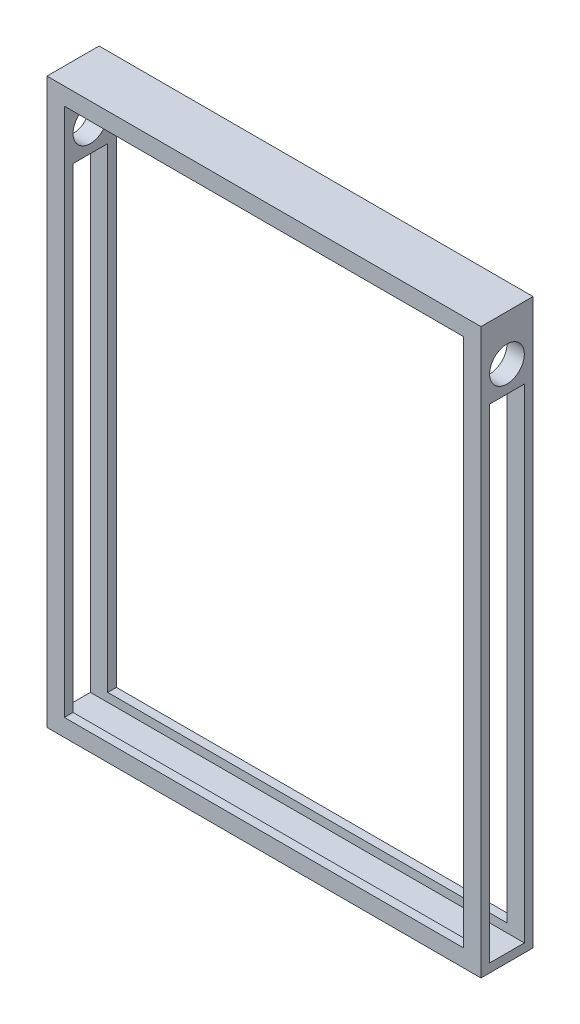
from build123d import *

# Parameters (mm, degrees)
SKETCH1_W          = 1270
SKETCH1_H          = 1651
SKETCH1_W_2        = 1168.4
SKETCH1_H_2        = 1549.4
BASE_EXTRUDE_DEPTH = 152.4
SKETCH2_R          = 50.8
SKETCH2_W          = 101.6
SKETCH2_H          = 1416.465539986
CUT_EXTRUDE1_DEPTH = 2024.093409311


with BuildPart() as part:
    # Sketch1 → Base-Extrude (new body)
    with BuildSketch(Plane.XY):
        with Locations((-529.570233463, 741.912256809)):
            Rectangle(SKETCH1_W, SKETCH1_H)
        with Locations((-529.570233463, 741.912256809)):
            Rectangle(SKETCH1_W_2, SKETCH1_H_2, mode=Mode.SUBTRACT)
    extrude(amount=BASE_EXTRUDE_DEPTH)

    # Sketch2 → Cut-Extrude1 (cut, through all)
    with BuildSketch(Plane.ZY.offset(1164.570233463)):
        with Locations((76.2, 1434.477796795)):
            Circle(SKETCH2_R)
        with Locations((76.2, 650.045026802)):
            Rectangle(SKETCH2_W, SKETCH2_H)
    extrude(amount=-CUT_EXTRUDE1_DEPTH, mode=Mode.SUBTRACT)


solid = part.part
